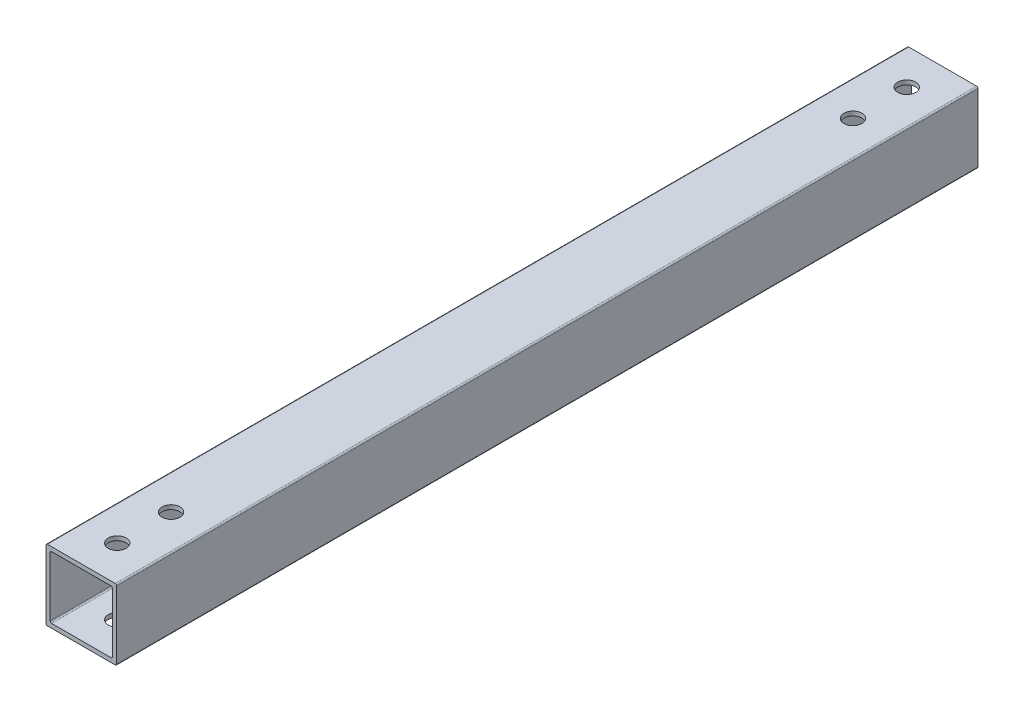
ISO-10303-21;
HEADER;
FILE_DESCRIPTION(('STEP AP214'),'2;1');
FILE_NAME('part.step','',(''),(''),'','','');
FILE_SCHEMA(('AUTOMOTIVE_DESIGN { 1 0 10303 214 1 1 1 1 }'));
ENDSEC;
DATA;
#1=APPLICATION_CONTEXT('core data for automotive mechanical design processes');
#2=APPLICATION_PROTOCOL_DEFINITION('international standard','automotive_design',2000,#1);
#3=PRODUCT_CONTEXT('',#1,'mechanical');
#4=PRODUCT('Part','Part','',(#3));
#5=PRODUCT_RELATED_PRODUCT_CATEGORY('part','',(#4));
#6=PRODUCT_DEFINITION_FORMATION('','',#4);
#7=PRODUCT_DEFINITION_CONTEXT('part definition',#1,'design');
#8=PRODUCT_DEFINITION('design','',#6,#7);
#9=PRODUCT_DEFINITION_SHAPE('','',#8);
#10=(LENGTH_UNIT() NAMED_UNIT(*) SI_UNIT(.MILLI.,.METRE.));
#11=(NAMED_UNIT(*) PLANE_ANGLE_UNIT() SI_UNIT($,.RADIAN.));
#12=(NAMED_UNIT(*) SI_UNIT($,.STERADIAN.) SOLID_ANGLE_UNIT());
#13=UNCERTAINTY_MEASURE_WITH_UNIT(LENGTH_MEASURE(1.E-05),#10,'distance_accuracy_value','');
#14=(GEOMETRIC_REPRESENTATION_CONTEXT(3) GLOBAL_UNCERTAINTY_ASSIGNED_CONTEXT((#13)) GLOBAL_UNIT_ASSIGNED_CONTEXT((#10,
#11,#12)) REPRESENTATION_CONTEXT('',''));
#15=CARTESIAN_POINT('',(0.,0.,0.));
#16=DIRECTION('',(0.,0.,1.));
#17=DIRECTION('',(1.,0.,0.));
#18=AXIS2_PLACEMENT_3D('',#15,#16,#17);
#19=CARTESIAN_POINT('',(-11.9999999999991,-11.9999999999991,-1695.2));
#20=DIRECTION('',(0.,0.,-1.));
#21=DIRECTION('',(-1.,0.,0.));
#22=AXIS2_PLACEMENT_3D('',#19,#20,#21);
#23=CYLINDRICAL_SURFACE('',#22,0.500000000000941);
#24=CARTESIAN_POINT('',(-11.9999999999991,-11.9999999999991,-2000.));
#25=DIRECTION('',(0.,0.,-1.));
#26=DIRECTION('',(-1.,0.,0.));
#27=AXIS2_PLACEMENT_3D('',#24,#25,#26);
#28=CIRCLE('',#27,0.500000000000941);
#29=CARTESIAN_POINT('',(-11.9999999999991,-12.5,-2000.));
#30=VERTEX_POINT('',#29);
#31=CARTESIAN_POINT('',(-12.5,-11.9999999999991,-2000.));
#32=VERTEX_POINT('',#31);
#33=EDGE_CURVE('E220',#30,#32,#28,.T.);
#34=ORIENTED_EDGE('',*,*,#33,.F.);
#35=DIRECTION('',(0.,0.,-1.));
#36=VECTOR('',#35,1.);
#37=CARTESIAN_POINT('',(-11.9999999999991,-12.5,-1695.2));
#38=LINE('',#37,#36);
#39=CARTESIAN_POINT('',(-11.9999999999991,-12.5,-1695.2));
#40=VERTEX_POINT('',#39);
#41=EDGE_CURVE('E11',#40,#30,#38,.T.);
#42=ORIENTED_EDGE('',*,*,#41,.F.);
#43=CARTESIAN_POINT('',(-11.9999999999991,-11.9999999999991,-1695.2));
#44=DIRECTION('',(0.,0.,-1.));
#45=DIRECTION('',(-1.,0.,0.));
#46=AXIS2_PLACEMENT_3D('',#43,#44,#45);
#47=CIRCLE('',#46,0.500000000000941);
#48=CARTESIAN_POINT('',(-12.5,-11.9999999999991,-1695.2));
#49=VERTEX_POINT('',#48);
#50=EDGE_CURVE('E232',#40,#49,#47,.T.);
#51=ORIENTED_EDGE('',*,*,#50,.T.);
#52=DIRECTION('',(0.,0.,-1.));
#53=VECTOR('',#52,1.);
#54=CARTESIAN_POINT('',(-12.5,-11.9999999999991,-1695.2));
#55=LINE('',#54,#53);
#56=EDGE_CURVE('E257',#49,#32,#55,.T.);
#57=ORIENTED_EDGE('',*,*,#56,.T.);
#58=EDGE_LOOP('',(#34,#42,#51,#57));
#59=FACE_BOUND('',#58,.T.);
#60=ADVANCED_FACE('F47',(#59),#23,.T.);
#61=CARTESIAN_POINT('',(11.9999999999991,-12.5,-1695.2));
#62=DIRECTION('',(0.,-1.,0.));
#63=DIRECTION('',(1.,0.,0.));
#64=AXIS2_PLACEMENT_3D('',#61,#62,#63);
#65=PLANE('',#64);
#66=CARTESIAN_POINT('',(0.,-12.5,-1987.3));
#67=DIRECTION('',(0.,-1.,0.));
#68=DIRECTION('',(1.,0.,0.));
#69=AXIS2_PLACEMENT_3D('',#66,#67,#68);
#70=CIRCLE('',#69,3.17500000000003);
#71=CARTESIAN_POINT('',(3.17500000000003,-12.5,-1987.3));
#72=VERTEX_POINT('',#71);
#73=EDGE_CURVE('E296',#72,#72,#70,.F.);
#74=ORIENTED_EDGE('',*,*,#73,.T.);
#75=EDGE_LOOP('',(#74));
#76=FACE_BOUND('',#75,.T.);
#77=CARTESIAN_POINT('',(0.,-12.5,-1726.95));
#78=DIRECTION('',(0.,-1.,0.));
#79=DIRECTION('',(1.,0.,0.));
#80=AXIS2_PLACEMENT_3D('',#77,#78,#79);
#81=CIRCLE('',#80,3.17500000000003);
#82=CARTESIAN_POINT('',(3.17500000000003,-12.5,-1726.95));
#83=VERTEX_POINT('',#82);
#84=EDGE_CURVE('E329',#83,#83,#81,.F.);
#85=ORIENTED_EDGE('',*,*,#84,.T.);
#86=EDGE_LOOP('',(#85));
#87=FACE_BOUND('',#86,.T.);
#88=CARTESIAN_POINT('',(0.,-12.5,-1707.9));
#89=DIRECTION('',(0.,-1.,0.));
#90=DIRECTION('',(1.,0.,0.));
#91=AXIS2_PLACEMENT_3D('',#88,#89,#90);
#92=CIRCLE('',#91,3.17500000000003);
#93=CARTESIAN_POINT('',(3.17500000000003,-12.5,-1707.9));
#94=VERTEX_POINT('',#93);
#95=EDGE_CURVE('E317',#94,#94,#92,.F.);
#96=ORIENTED_EDGE('',*,*,#95,.T.);
#97=EDGE_LOOP('',(#96));
#98=FACE_BOUND('',#97,.T.);
#99=CARTESIAN_POINT('',(0.,-12.5,-1968.25));
#100=DIRECTION('',(0.,-1.,0.));
#101=DIRECTION('',(1.,0.,0.));
#102=AXIS2_PLACEMENT_3D('',#99,#100,#101);
#103=CIRCLE('',#102,3.17500000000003);
#104=CARTESIAN_POINT('',(3.17500000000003,-12.5,-1968.25));
#105=VERTEX_POINT('',#104);
#106=EDGE_CURVE('E316',#105,#105,#103,.F.);
#107=ORIENTED_EDGE('',*,*,#106,.T.);
#108=EDGE_LOOP('',(#107));
#109=FACE_BOUND('',#108,.T.);
#110=DIRECTION('',(-1.,0.,0.));
#111=VECTOR('',#110,1.);
#112=CARTESIAN_POINT('',(11.9999999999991,-12.5,-2000.));
#113=LINE('',#112,#111);
#114=CARTESIAN_POINT('',(11.9999999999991,-12.5,-2000.));
#115=VERTEX_POINT('',#114);
#116=EDGE_CURVE('E236',#115,#30,#113,.T.);
#117=ORIENTED_EDGE('',*,*,#116,.F.);
#118=DIRECTION('',(0.,0.,-1.));
#119=VECTOR('',#118,1.);
#120=CARTESIAN_POINT('',(11.9999999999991,-12.5,-1695.2));
#121=LINE('',#120,#119);
#122=CARTESIAN_POINT('',(11.9999999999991,-12.5,-1695.2));
#123=VERTEX_POINT('',#122);
#124=EDGE_CURVE('E55',#123,#115,#121,.T.);
#125=ORIENTED_EDGE('',*,*,#124,.F.);
#126=DIRECTION('',(-1.,0.,0.));
#127=VECTOR('',#126,1.);
#128=CARTESIAN_POINT('',(11.9999999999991,-12.5,-1695.2));
#129=LINE('',#128,#127);
#130=EDGE_CURVE('E254',#123,#40,#129,.T.);
#131=ORIENTED_EDGE('',*,*,#130,.T.);
#132=ORIENTED_EDGE('',*,*,#41,.T.);
#133=EDGE_LOOP('',(#117,#125,#131,#132));
#134=FACE_BOUND('',#133,.T.);
#135=ADVANCED_FACE('F372',(#76,#87,#98,#109,#134),#65,.T.);
#136=CARTESIAN_POINT('',(11.9999999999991,-11.9999999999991,-1695.2));
#137=DIRECTION('',(0.,0.,-1.));
#138=DIRECTION('',(-1.,0.,0.));
#139=AXIS2_PLACEMENT_3D('',#136,#137,#138);
#140=CYLINDRICAL_SURFACE('',#139,0.500000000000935);
#141=CARTESIAN_POINT('',(11.9999999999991,-11.9999999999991,-2000.));
#142=DIRECTION('',(0.,0.,-1.));
#143=DIRECTION('',(-1.,0.,0.));
#144=AXIS2_PLACEMENT_3D('',#141,#142,#143);
#145=CIRCLE('',#144,0.500000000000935);
#146=CARTESIAN_POINT('',(12.5,-11.9999999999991,-2000.));
#147=VERTEX_POINT('',#146);
#148=EDGE_CURVE('E275',#147,#115,#145,.T.);
#149=ORIENTED_EDGE('',*,*,#148,.F.);
#150=DIRECTION('',(0.,0.,-1.));
#151=VECTOR('',#150,1.);
#152=CARTESIAN_POINT('',(12.5,-11.9999999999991,-1695.2));
#153=LINE('',#152,#151);
#154=CARTESIAN_POINT('',(12.5,-11.9999999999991,-1695.2));
#155=VERTEX_POINT('',#154);
#156=EDGE_CURVE('E281',#155,#147,#153,.T.);
#157=ORIENTED_EDGE('',*,*,#156,.F.);
#158=CARTESIAN_POINT('',(11.9999999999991,-11.9999999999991,-1695.2));
#159=DIRECTION('',(0.,0.,-1.));
#160=DIRECTION('',(-1.,0.,0.));
#161=AXIS2_PLACEMENT_3D('',#158,#159,#160);
#162=CIRCLE('',#161,0.500000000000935);
#163=EDGE_CURVE('E251',#155,#123,#162,.T.);
#164=ORIENTED_EDGE('',*,*,#163,.T.);
#165=ORIENTED_EDGE('',*,*,#124,.T.);
#166=EDGE_LOOP('',(#149,#157,#164,#165));
#167=FACE_BOUND('',#166,.T.);
#168=ADVANCED_FACE('F375',(#167),#140,.T.);
#169=CARTESIAN_POINT('',(12.5,11.9999999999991,-1695.2));
#170=DIRECTION('',(1.,0.,0.));
#171=DIRECTION('',(0.,1.,0.));
#172=AXIS2_PLACEMENT_3D('',#169,#170,#171);
#173=PLANE('',#172);
#174=DIRECTION('',(0.,-1.,0.));
#175=VECTOR('',#174,1.);
#176=CARTESIAN_POINT('',(12.5,11.9999999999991,-2000.));
#177=LINE('',#176,#175);
#178=CARTESIAN_POINT('',(12.5,11.9999999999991,-2000.));
#179=VERTEX_POINT('',#178);
#180=EDGE_CURVE('E272',#179,#147,#177,.T.);
#181=ORIENTED_EDGE('',*,*,#180,.F.);
#182=DIRECTION('',(0.,0.,-1.));
#183=VECTOR('',#182,1.);
#184=CARTESIAN_POINT('',(12.5,11.9999999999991,-1695.2));
#185=LINE('',#184,#183);
#186=CARTESIAN_POINT('',(12.5,11.9999999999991,-1695.2));
#187=VERTEX_POINT('',#186);
#188=EDGE_CURVE('E283',#187,#179,#185,.T.);
#189=ORIENTED_EDGE('',*,*,#188,.F.);
#190=DIRECTION('',(0.,-1.,0.));
#191=VECTOR('',#190,1.);
#192=CARTESIAN_POINT('',(12.5,11.9999999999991,-1695.2));
#193=LINE('',#192,#191);
#194=EDGE_CURVE('E248',#187,#155,#193,.T.);
#195=ORIENTED_EDGE('',*,*,#194,.T.);
#196=ORIENTED_EDGE('',*,*,#156,.T.);
#197=EDGE_LOOP('',(#181,#189,#195,#196));
#198=FACE_BOUND('',#197,.T.);
#199=ADVANCED_FACE('F379',(#198),#173,.T.);
#200=CARTESIAN_POINT('',(11.9999999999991,11.9999999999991,-1695.2));
#201=DIRECTION('',(0.,0.,-1.));
#202=DIRECTION('',(-1.,0.,0.));
#203=AXIS2_PLACEMENT_3D('',#200,#201,#202);
#204=CYLINDRICAL_SURFACE('',#203,0.500000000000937);
#205=CARTESIAN_POINT('',(11.9999999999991,11.9999999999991,-2000.));
#206=DIRECTION('',(0.,0.,-1.));
#207=DIRECTION('',(-1.,0.,0.));
#208=AXIS2_PLACEMENT_3D('',#205,#206,#207);
#209=CIRCLE('',#208,0.500000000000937);
#210=CARTESIAN_POINT('',(11.9999999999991,12.5,-2000.));
#211=VERTEX_POINT('',#210);
#212=EDGE_CURVE('E269',#211,#179,#209,.T.);
#213=ORIENTED_EDGE('',*,*,#212,.F.);
#214=DIRECTION('',(0.,0.,-1.));
#215=VECTOR('',#214,1.);
#216=CARTESIAN_POINT('',(11.9999999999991,12.5,-1695.2));
#217=LINE('',#216,#215);
#218=CARTESIAN_POINT('',(11.9999999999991,12.5,-1695.2));
#219=VERTEX_POINT('',#218);
#220=EDGE_CURVE('E285',#219,#211,#217,.T.);
#221=ORIENTED_EDGE('',*,*,#220,.F.);
#222=CARTESIAN_POINT('',(11.9999999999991,11.9999999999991,-1695.2));
#223=DIRECTION('',(0.,0.,-1.));
#224=DIRECTION('',(-1.,0.,0.));
#225=AXIS2_PLACEMENT_3D('',#222,#223,#224);
#226=CIRCLE('',#225,0.500000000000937);
#227=EDGE_CURVE('E245',#219,#187,#226,.T.);
#228=ORIENTED_EDGE('',*,*,#227,.T.);
#229=ORIENTED_EDGE('',*,*,#188,.T.);
#230=EDGE_LOOP('',(#213,#221,#228,#229));
#231=FACE_BOUND('',#230,.T.);
#232=ADVANCED_FACE('F344',(#231),#204,.T.);
#233=CARTESIAN_POINT('',(-11.9999999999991,12.5,-1695.2));
#234=DIRECTION('',(0.,1.,0.));
#235=DIRECTION('',(-1.,0.,0.));
#236=AXIS2_PLACEMENT_3D('',#233,#234,#235);
#237=PLANE('',#236);
#238=CARTESIAN_POINT('',(0.,12.5,-1987.3));
#239=DIRECTION('',(0.,1.,0.));
#240=DIRECTION('',(-1.,0.,0.));
#241=AXIS2_PLACEMENT_3D('',#238,#239,#240);
#242=CIRCLE('',#241,3.17500000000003);
#243=CARTESIAN_POINT('',(-3.17500000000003,12.5,-1987.3));
#244=VERTEX_POINT('',#243);
#245=EDGE_CURVE('E324',#244,#244,#242,.T.);
#246=ORIENTED_EDGE('',*,*,#245,.F.);
#247=EDGE_LOOP('',(#246));
#248=FACE_BOUND('',#247,.T.);
#249=CARTESIAN_POINT('',(0.,12.5,-1726.95));
#250=DIRECTION('',(0.,1.,0.));
#251=DIRECTION('',(1.,0.,0.));
#252=AXIS2_PLACEMENT_3D('',#249,#250,#251);
#253=CIRCLE('',#252,3.17500000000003);
#254=CARTESIAN_POINT('',(3.17500000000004,12.5,-1726.95));
#255=VERTEX_POINT('',#254);
#256=EDGE_CURVE('E320',#255,#255,#253,.T.);
#257=ORIENTED_EDGE('',*,*,#256,.F.);
#258=EDGE_LOOP('',(#257));
#259=FACE_BOUND('',#258,.T.);
#260=CARTESIAN_POINT('',(0.,12.5,-1707.9));
#261=DIRECTION('',(0.,1.,0.));
#262=DIRECTION('',(1.,0.,0.));
#263=AXIS2_PLACEMENT_3D('',#260,#261,#262);
#264=CIRCLE('',#263,3.17500000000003);
#265=CARTESIAN_POINT('',(3.17500000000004,12.5,-1707.9));
#266=VERTEX_POINT('',#265);
#267=EDGE_CURVE('E313',#266,#266,#264,.T.);
#268=ORIENTED_EDGE('',*,*,#267,.F.);
#269=EDGE_LOOP('',(#268));
#270=FACE_BOUND('',#269,.T.);
#271=CARTESIAN_POINT('',(0.,12.5,-1968.25));
#272=DIRECTION('',(0.,1.,0.));
#273=DIRECTION('',(-1.,0.,0.));
#274=AXIS2_PLACEMENT_3D('',#271,#272,#273);
#275=CIRCLE('',#274,3.17500000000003);
#276=CARTESIAN_POINT('',(-3.17500000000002,12.5,-1968.25));
#277=VERTEX_POINT('',#276);
#278=EDGE_CURVE('E321',#277,#277,#275,.T.);
#279=ORIENTED_EDGE('',*,*,#278,.F.);
#280=EDGE_LOOP('',(#279));
#281=FACE_BOUND('',#280,.T.);
#282=DIRECTION('',(1.,0.,0.));
#283=VECTOR('',#282,1.);
#284=CARTESIAN_POINT('',(-11.9999999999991,12.5,-2000.));
#285=LINE('',#284,#283);
#286=CARTESIAN_POINT('',(-11.9999999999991,12.5,-2000.));
#287=VERTEX_POINT('',#286);
#288=EDGE_CURVE('E266',#287,#211,#285,.T.);
#289=ORIENTED_EDGE('',*,*,#288,.F.);
#290=DIRECTION('',(0.,0.,-1.));
#291=VECTOR('',#290,1.);
#292=CARTESIAN_POINT('',(-11.9999999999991,12.5,-1695.2));
#293=LINE('',#292,#291);
#294=CARTESIAN_POINT('',(-11.9999999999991,12.5,-1695.2));
#295=VERTEX_POINT('',#294);
#296=EDGE_CURVE('E287',#295,#287,#293,.T.);
#297=ORIENTED_EDGE('',*,*,#296,.F.);
#298=DIRECTION('',(1.,0.,0.));
#299=VECTOR('',#298,1.);
#300=CARTESIAN_POINT('',(-11.9999999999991,12.5,-1695.2));
#301=LINE('',#300,#299);
#302=EDGE_CURVE('E242',#295,#219,#301,.T.);
#303=ORIENTED_EDGE('',*,*,#302,.T.);
#304=ORIENTED_EDGE('',*,*,#220,.T.);
#305=EDGE_LOOP('',(#289,#297,#303,#304));
#306=FACE_BOUND('',#305,.T.);
#307=ADVANCED_FACE('F340',(#248,#259,#270,#281,#306),#237,.T.);
#308=CARTESIAN_POINT('',(-11.9999999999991,11.9999999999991,-1695.2));
#309=DIRECTION('',(0.,0.,-1.));
#310=DIRECTION('',(-1.,0.,0.));
#311=AXIS2_PLACEMENT_3D('',#308,#309,#310);
#312=CYLINDRICAL_SURFACE('',#311,0.500000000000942);
#313=CARTESIAN_POINT('',(-11.9999999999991,11.9999999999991,-2000.));
#314=DIRECTION('',(0.,0.,-1.));
#315=DIRECTION('',(-1.,0.,0.));
#316=AXIS2_PLACEMENT_3D('',#313,#314,#315);
#317=CIRCLE('',#316,0.500000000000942);
#318=CARTESIAN_POINT('',(-12.5,11.9999999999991,-2000.));
#319=VERTEX_POINT('',#318);
#320=EDGE_CURVE('E263',#319,#287,#317,.T.);
#321=ORIENTED_EDGE('',*,*,#320,.F.);
#322=DIRECTION('',(0.,0.,-1.));
#323=VECTOR('',#322,1.);
#324=CARTESIAN_POINT('',(-12.5,11.9999999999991,-1695.2));
#325=LINE('',#324,#323);
#326=CARTESIAN_POINT('',(-12.5,11.9999999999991,-1695.2));
#327=VERTEX_POINT('',#326);
#328=EDGE_CURVE('E289',#327,#319,#325,.T.);
#329=ORIENTED_EDGE('',*,*,#328,.F.);
#330=CARTESIAN_POINT('',(-11.9999999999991,11.9999999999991,-1695.2));
#331=DIRECTION('',(0.,0.,-1.));
#332=DIRECTION('',(-1.,0.,0.));
#333=AXIS2_PLACEMENT_3D('',#330,#331,#332);
#334=CIRCLE('',#333,0.500000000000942);
#335=EDGE_CURVE('E239',#327,#295,#334,.T.);
#336=ORIENTED_EDGE('',*,*,#335,.T.);
#337=ORIENTED_EDGE('',*,*,#296,.T.);
#338=EDGE_LOOP('',(#321,#329,#336,#337));
#339=FACE_BOUND('',#338,.T.);
#340=ADVANCED_FACE('F343',(#339),#312,.T.);
#341=CARTESIAN_POINT('',(-12.5,-11.9999999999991,-1695.2));
#342=DIRECTION('',(-1.,0.,0.));
#343=DIRECTION('',(0.,0.,1.));
#344=AXIS2_PLACEMENT_3D('',#341,#342,#343);
#345=PLANE('',#344);
#346=DIRECTION('',(0.,1.,0.));
#347=VECTOR('',#346,1.);
#348=CARTESIAN_POINT('',(-12.5,-11.9999999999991,-2000.));
#349=LINE('',#348,#347);
#350=EDGE_CURVE('E260',#32,#319,#349,.T.);
#351=ORIENTED_EDGE('',*,*,#350,.F.);
#352=ORIENTED_EDGE('',*,*,#56,.F.);
#353=DIRECTION('',(0.,1.,0.));
#354=VECTOR('',#353,1.);
#355=CARTESIAN_POINT('',(-12.5,-11.9999999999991,-1695.2));
#356=LINE('',#355,#354);
#357=EDGE_CURVE('E235',#49,#327,#356,.T.);
#358=ORIENTED_EDGE('',*,*,#357,.T.);
#359=ORIENTED_EDGE('',*,*,#328,.T.);
#360=EDGE_LOOP('',(#351,#352,#358,#359));
#361=FACE_BOUND('',#360,.T.);
#362=ADVANCED_FACE('F365',(#361),#345,.T.);
#363=CARTESIAN_POINT('',(-11.9999999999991,-11.9999999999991,-1695.2));
#364=DIRECTION('',(0.,0.,-1.));
#365=DIRECTION('',(-1.,0.,0.));
#366=AXIS2_PLACEMENT_3D('',#363,#364,#365);
#367=PLANE('',#366);
#368=DIRECTION('',(0.,1.,0.));
#369=VECTOR('',#368,1.);
#370=CARTESIAN_POINT('',(-11.,10.4999999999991,-1695.2));
#371=LINE('',#370,#369);
#372=CARTESIAN_POINT('',(-11.,-10.4999999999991,-1695.2));
#373=VERTEX_POINT('',#372);
#374=CARTESIAN_POINT('',(-11.,10.4999999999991,-1695.2));
#375=VERTEX_POINT('',#374);
#376=EDGE_CURVE('E168',#373,#375,#371,.T.);
#377=ORIENTED_EDGE('',*,*,#376,.T.);
#378=CARTESIAN_POINT('',(-10.4999999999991,10.4999999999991,-1695.2));
#379=DIRECTION('',(0.,0.,-1.));
#380=DIRECTION('',(1.,0.,0.));
#381=AXIS2_PLACEMENT_3D('',#378,#379,#380);
#382=CIRCLE('',#381,0.500000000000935);
#383=CARTESIAN_POINT('',(-10.4999999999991,11.,-1695.2));
#384=VERTEX_POINT('',#383);
#385=EDGE_CURVE('E162',#375,#384,#382,.T.);
#386=ORIENTED_EDGE('',*,*,#385,.T.);
#387=DIRECTION('',(1.,0.,0.));
#388=VECTOR('',#387,1.);
#389=CARTESIAN_POINT('',(10.4999999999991,11.,-1695.2));
#390=LINE('',#389,#388);
#391=CARTESIAN_POINT('',(10.4999999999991,11.,-1695.2));
#392=VERTEX_POINT('',#391);
#393=EDGE_CURVE('E171',#384,#392,#390,.T.);
#394=ORIENTED_EDGE('',*,*,#393,.T.);
#395=CARTESIAN_POINT('',(10.4999999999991,10.4999999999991,-1695.2));
#396=DIRECTION('',(0.,0.,-1.));
#397=DIRECTION('',(1.,0.,0.));
#398=AXIS2_PLACEMENT_3D('',#395,#396,#397);
#399=CIRCLE('',#398,0.500000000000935);
#400=CARTESIAN_POINT('',(11.,10.4999999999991,-1695.2));
#401=VERTEX_POINT('',#400);
#402=EDGE_CURVE('E63',#392,#401,#399,.T.);
#403=ORIENTED_EDGE('',*,*,#402,.T.);
#404=DIRECTION('',(0.,-1.,0.));
#405=VECTOR('',#404,1.);
#406=CARTESIAN_POINT('',(11.,-10.4999999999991,-1695.2));
#407=LINE('',#406,#405);
#408=CARTESIAN_POINT('',(11.,-10.4999999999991,-1695.2));
#409=VERTEX_POINT('',#408);
#410=EDGE_CURVE('E189',#401,#409,#407,.T.);
#411=ORIENTED_EDGE('',*,*,#410,.T.);
#412=CARTESIAN_POINT('',(10.4999999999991,-10.4999999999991,-1695.2));
#413=DIRECTION('',(0.,0.,-1.));
#414=DIRECTION('',(1.,0.,0.));
#415=AXIS2_PLACEMENT_3D('',#412,#413,#414);
#416=CIRCLE('',#415,0.500000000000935);
#417=CARTESIAN_POINT('',(10.4999999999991,-11.,-1695.2));
#418=VERTEX_POINT('',#417);
#419=EDGE_CURVE('E192',#409,#418,#416,.T.);
#420=ORIENTED_EDGE('',*,*,#419,.T.);
#421=DIRECTION('',(-1.,0.,0.));
#422=VECTOR('',#421,1.);
#423=CARTESIAN_POINT('',(-10.4999999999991,-11.,-1695.2));
#424=LINE('',#423,#422);
#425=CARTESIAN_POINT('',(-10.4999999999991,-11.,-1695.2));
#426=VERTEX_POINT('',#425);
#427=EDGE_CURVE('E195',#418,#426,#424,.T.);
#428=ORIENTED_EDGE('',*,*,#427,.T.);
#429=CARTESIAN_POINT('',(-10.4999999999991,-10.4999999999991,-1695.2));
#430=DIRECTION('',(0.,0.,-1.));
#431=DIRECTION('',(1.,0.,0.));
#432=AXIS2_PLACEMENT_3D('',#429,#430,#431);
#433=CIRCLE('',#432,0.500000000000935);
#434=EDGE_CURVE('E198',#426,#373,#433,.T.);
#435=ORIENTED_EDGE('',*,*,#434,.T.);
#436=EDGE_LOOP('',(#377,#386,#394,#403,#411,#420,#428,#435));
#437=FACE_BOUND('',#436,.T.);
#438=ORIENTED_EDGE('',*,*,#50,.F.);
#439=ORIENTED_EDGE('',*,*,#130,.F.);
#440=ORIENTED_EDGE('',*,*,#163,.F.);
#441=ORIENTED_EDGE('',*,*,#194,.F.);
#442=ORIENTED_EDGE('',*,*,#227,.F.);
#443=ORIENTED_EDGE('',*,*,#302,.F.);
#444=ORIENTED_EDGE('',*,*,#335,.F.);
#445=ORIENTED_EDGE('',*,*,#357,.F.);
#446=EDGE_LOOP('',(#438,#439,#440,#441,#442,#443,#444,#445));
#447=FACE_BOUND('',#446,.T.);
#448=ADVANCED_FACE('F175',(#437,#447),#367,.F.);
#449=CARTESIAN_POINT('',(-11.9999999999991,-11.9999999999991,-2000.));
#450=DIRECTION('',(0.,0.,-1.));
#451=DIRECTION('',(-1.,0.,0.));
#452=AXIS2_PLACEMENT_3D('',#449,#450,#451);
#453=PLANE('',#452);
#454=CARTESIAN_POINT('',(-10.4999999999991,10.4999999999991,-2000.));
#455=DIRECTION('',(0.,0.,-1.));
#456=DIRECTION('',(1.,0.,0.));
#457=AXIS2_PLACEMENT_3D('',#454,#455,#456);
#458=CIRCLE('',#457,0.500000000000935);
#459=CARTESIAN_POINT('',(-11.,10.4999999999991,-2000.));
#460=VERTEX_POINT('',#459);
#461=CARTESIAN_POINT('',(-10.4999999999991,11.,-2000.));
#462=VERTEX_POINT('',#461);
#463=EDGE_CURVE('E71',#460,#462,#458,.T.);
#464=ORIENTED_EDGE('',*,*,#463,.F.);
#465=DIRECTION('',(0.,1.,0.));
#466=VECTOR('',#465,1.);
#467=CARTESIAN_POINT('',(-11.,10.4999999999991,-2000.));
#468=LINE('',#467,#466);
#469=CARTESIAN_POINT('',(-11.,-10.4999999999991,-2000.));
#470=VERTEX_POINT('',#469);
#471=EDGE_CURVE('E179',#470,#460,#468,.T.);
#472=ORIENTED_EDGE('',*,*,#471,.F.);
#473=CARTESIAN_POINT('',(-10.4999999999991,-10.4999999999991,-2000.));
#474=DIRECTION('',(0.,0.,-1.));
#475=DIRECTION('',(1.,0.,0.));
#476=AXIS2_PLACEMENT_3D('',#473,#474,#475);
#477=CIRCLE('',#476,0.500000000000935);
#478=CARTESIAN_POINT('',(-10.4999999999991,-11.,-2000.));
#479=VERTEX_POINT('',#478);
#480=EDGE_CURVE('E182',#479,#470,#477,.T.);
#481=ORIENTED_EDGE('',*,*,#480,.F.);
#482=DIRECTION('',(-1.,0.,0.));
#483=VECTOR('',#482,1.);
#484=CARTESIAN_POINT('',(-10.4999999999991,-11.,-2000.));
#485=LINE('',#484,#483);
#486=CARTESIAN_POINT('',(10.4999999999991,-11.,-2000.));
#487=VERTEX_POINT('',#486);
#488=EDGE_CURVE('E213',#487,#479,#485,.T.);
#489=ORIENTED_EDGE('',*,*,#488,.F.);
#490=CARTESIAN_POINT('',(10.4999999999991,-10.4999999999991,-2000.));
#491=DIRECTION('',(0.,0.,-1.));
#492=DIRECTION('',(1.,0.,0.));
#493=AXIS2_PLACEMENT_3D('',#490,#491,#492);
#494=CIRCLE('',#493,0.500000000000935);
#495=CARTESIAN_POINT('',(11.,-10.4999999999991,-2000.));
#496=VERTEX_POINT('',#495);
#497=EDGE_CURVE('E210',#496,#487,#494,.T.);
#498=ORIENTED_EDGE('',*,*,#497,.F.);
#499=DIRECTION('',(0.,-1.,0.));
#500=VECTOR('',#499,1.);
#501=CARTESIAN_POINT('',(11.,-10.4999999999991,-2000.));
#502=LINE('',#501,#500);
#503=CARTESIAN_POINT('',(11.,10.4999999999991,-2000.));
#504=VERTEX_POINT('',#503);
#505=EDGE_CURVE('E207',#504,#496,#502,.T.);
#506=ORIENTED_EDGE('',*,*,#505,.F.);
#507=CARTESIAN_POINT('',(10.4999999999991,10.4999999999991,-2000.));
#508=DIRECTION('',(0.,0.,-1.));
#509=DIRECTION('',(1.,0.,0.));
#510=AXIS2_PLACEMENT_3D('',#507,#508,#509);
#511=CIRCLE('',#510,0.500000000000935);
#512=CARTESIAN_POINT('',(10.4999999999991,11.,-2000.));
#513=VERTEX_POINT('',#512);
#514=EDGE_CURVE('E204',#513,#504,#511,.T.);
#515=ORIENTED_EDGE('',*,*,#514,.F.);
#516=DIRECTION('',(1.,0.,0.));
#517=VECTOR('',#516,1.);
#518=CARTESIAN_POINT('',(10.4999999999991,11.,-2000.));
#519=LINE('',#518,#517);
#520=EDGE_CURVE('E202',#462,#513,#519,.T.);
#521=ORIENTED_EDGE('',*,*,#520,.F.);
#522=EDGE_LOOP('',(#464,#472,#481,#489,#498,#506,#515,#521));
#523=FACE_BOUND('',#522,.T.);
#524=ORIENTED_EDGE('',*,*,#33,.T.);
#525=ORIENTED_EDGE('',*,*,#350,.T.);
#526=ORIENTED_EDGE('',*,*,#320,.T.);
#527=ORIENTED_EDGE('',*,*,#288,.T.);
#528=ORIENTED_EDGE('',*,*,#212,.T.);
#529=ORIENTED_EDGE('',*,*,#180,.T.);
#530=ORIENTED_EDGE('',*,*,#148,.T.);
#531=ORIENTED_EDGE('',*,*,#116,.T.);
#532=EDGE_LOOP('',(#524,#525,#526,#527,#528,#529,#530,#531));
#533=FACE_BOUND('',#532,.T.);
#534=ADVANCED_FACE('F357',(#523,#533),#453,.T.);
#535=CARTESIAN_POINT('',(-10.4999999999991,10.4999999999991,-1695.2));
#536=DIRECTION('',(0.,0.,-1.));
#537=DIRECTION('',(-1.,0.,0.));
#538=AXIS2_PLACEMENT_3D('',#535,#536,#537);
#539=CYLINDRICAL_SURFACE('',#538,0.500000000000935);
#540=ORIENTED_EDGE('',*,*,#463,.T.);
#541=DIRECTION('',(0.,0.,-1.));
#542=VECTOR('',#541,1.);
#543=CARTESIAN_POINT('',(-10.4999999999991,11.,-1695.2));
#544=LINE('',#543,#542);
#545=EDGE_CURVE('E158',#384,#462,#544,.T.);
#546=ORIENTED_EDGE('',*,*,#545,.F.);
#547=ORIENTED_EDGE('',*,*,#385,.F.);
#548=DIRECTION('',(0.,0.,-1.));
#549=VECTOR('',#548,1.);
#550=CARTESIAN_POINT('',(-11.,10.4999999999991,-1695.2));
#551=LINE('',#550,#549);
#552=EDGE_CURVE('E218',#375,#460,#551,.T.);
#553=ORIENTED_EDGE('',*,*,#552,.T.);
#554=EDGE_LOOP('',(#540,#546,#547,#553));
#555=FACE_BOUND('',#554,.T.);
#556=ADVANCED_FACE('F160',(#555),#539,.F.);
#557=CARTESIAN_POINT('',(-11.,10.4999999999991,-1695.2));
#558=DIRECTION('',(-1.,0.,0.));
#559=DIRECTION('',(0.,-1.,0.));
#560=AXIS2_PLACEMENT_3D('',#557,#558,#559);
#561=PLANE('',#560);
#562=ORIENTED_EDGE('',*,*,#471,.T.);
#563=ORIENTED_EDGE('',*,*,#552,.F.);
#564=ORIENTED_EDGE('',*,*,#376,.F.);
#565=DIRECTION('',(0.,0.,-1.));
#566=VECTOR('',#565,1.);
#567=CARTESIAN_POINT('',(-11.,-10.4999999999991,-1695.2));
#568=LINE('',#567,#566);
#569=EDGE_CURVE('E221',#373,#470,#568,.T.);
#570=ORIENTED_EDGE('',*,*,#569,.T.);
#571=EDGE_LOOP('',(#562,#563,#564,#570));
#572=FACE_BOUND('',#571,.T.);
#573=ADVANCED_FACE('F406',(#572),#561,.F.);
#574=CARTESIAN_POINT('',(-10.4999999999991,-10.4999999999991,-1695.2));
#575=DIRECTION('',(0.,0.,-1.));
#576=DIRECTION('',(-1.,0.,0.));
#577=AXIS2_PLACEMENT_3D('',#574,#575,#576);
#578=CYLINDRICAL_SURFACE('',#577,0.500000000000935);
#579=ORIENTED_EDGE('',*,*,#480,.T.);
#580=ORIENTED_EDGE('',*,*,#569,.F.);
#581=ORIENTED_EDGE('',*,*,#434,.F.);
#582=DIRECTION('',(0.,0.,-1.));
#583=VECTOR('',#582,1.);
#584=CARTESIAN_POINT('',(-10.4999999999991,-11.,-1695.2));
#585=LINE('',#584,#583);
#586=EDGE_CURVE('E223',#426,#479,#585,.T.);
#587=ORIENTED_EDGE('',*,*,#586,.T.);
#588=EDGE_LOOP('',(#579,#580,#581,#587));
#589=FACE_BOUND('',#588,.T.);
#590=ADVANCED_FACE('F425',(#589),#578,.F.);
#591=CARTESIAN_POINT('',(-10.4999999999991,-11.,-1695.2));
#592=DIRECTION('',(0.,-1.,0.));
#593=DIRECTION('',(0.,0.,-1.));
#594=AXIS2_PLACEMENT_3D('',#591,#592,#593);
#595=PLANE('',#594);
#596=CARTESIAN_POINT('',(0.,-11.,-1987.3));
#597=DIRECTION('',(0.,-1.,0.));
#598=DIRECTION('',(0.,0.,-1.));
#599=AXIS2_PLACEMENT_3D('',#596,#597,#598);
#600=CIRCLE('',#599,3.17500000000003);
#601=CARTESIAN_POINT('',(0.,-11.,-1990.475));
#602=VERTEX_POINT('',#601);
#603=EDGE_CURVE('E185',#602,#602,#600,.T.);
#604=ORIENTED_EDGE('',*,*,#603,.T.);
#605=EDGE_LOOP('',(#604));
#606=FACE_BOUND('',#605,.T.);
#607=CARTESIAN_POINT('',(0.,-11.,-1726.95));
#608=DIRECTION('',(0.,-1.,0.));
#609=DIRECTION('',(0.,0.,-1.));
#610=AXIS2_PLACEMENT_3D('',#607,#608,#609);
#611=CIRCLE('',#610,3.17500000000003);
#612=CARTESIAN_POINT('',(0.,-11.,-1730.125));
#613=VERTEX_POINT('',#612);
#614=EDGE_CURVE('E302',#613,#613,#611,.T.);
#615=ORIENTED_EDGE('',*,*,#614,.T.);
#616=EDGE_LOOP('',(#615));
#617=FACE_BOUND('',#616,.T.);
#618=CARTESIAN_POINT('',(0.,-11.,-1707.9));
#619=DIRECTION('',(0.,-1.,0.));
#620=DIRECTION('',(0.,0.,-1.));
#621=AXIS2_PLACEMENT_3D('',#618,#619,#620);
#622=CIRCLE('',#621,3.17500000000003);
#623=CARTESIAN_POINT('',(0.,-11.,-1711.075));
#624=VERTEX_POINT('',#623);
#625=EDGE_CURVE('E299',#624,#624,#622,.T.);
#626=ORIENTED_EDGE('',*,*,#625,.T.);
#627=EDGE_LOOP('',(#626));
#628=FACE_BOUND('',#627,.T.);
#629=CARTESIAN_POINT('',(0.,-11.,-1968.25));
#630=DIRECTION('',(0.,-1.,0.));
#631=DIRECTION('',(0.,0.,-1.));
#632=AXIS2_PLACEMENT_3D('',#629,#630,#631);
#633=CIRCLE('',#632,3.17500000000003);
#634=CARTESIAN_POINT('',(0.,-11.,-1971.425));
#635=VERTEX_POINT('',#634);
#636=EDGE_CURVE('E295',#635,#635,#633,.T.);
#637=ORIENTED_EDGE('',*,*,#636,.T.);
#638=EDGE_LOOP('',(#637));
#639=FACE_BOUND('',#638,.T.);
#640=ORIENTED_EDGE('',*,*,#488,.T.);
#641=ORIENTED_EDGE('',*,*,#586,.F.);
#642=ORIENTED_EDGE('',*,*,#427,.F.);
#643=DIRECTION('',(0.,0.,-1.));
#644=VECTOR('',#643,1.);
#645=CARTESIAN_POINT('',(10.4999999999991,-11.,-1695.2));
#646=LINE('',#645,#644);
#647=EDGE_CURVE('E225',#418,#487,#646,.T.);
#648=ORIENTED_EDGE('',*,*,#647,.T.);
#649=EDGE_LOOP('',(#640,#641,#642,#648));
#650=FACE_BOUND('',#649,.T.);
#651=ADVANCED_FACE('F421',(#606,#617,#628,#639,#650),#595,.F.);
#652=CARTESIAN_POINT('',(10.4999999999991,-10.4999999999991,-1695.2));
#653=DIRECTION('',(0.,0.,-1.));
#654=DIRECTION('',(-1.,0.,0.));
#655=AXIS2_PLACEMENT_3D('',#652,#653,#654);
#656=CYLINDRICAL_SURFACE('',#655,0.500000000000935);
#657=ORIENTED_EDGE('',*,*,#497,.T.);
#658=ORIENTED_EDGE('',*,*,#647,.F.);
#659=ORIENTED_EDGE('',*,*,#419,.F.);
#660=DIRECTION('',(0.,0.,-1.));
#661=VECTOR('',#660,1.);
#662=CARTESIAN_POINT('',(11.,-10.4999999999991,-1695.2));
#663=LINE('',#662,#661);
#664=EDGE_CURVE('E227',#409,#496,#663,.T.);
#665=ORIENTED_EDGE('',*,*,#664,.T.);
#666=EDGE_LOOP('',(#657,#658,#659,#665));
#667=FACE_BOUND('',#666,.T.);
#668=ADVANCED_FACE('F417',(#667),#656,.F.);
#669=CARTESIAN_POINT('',(11.,-10.4999999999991,-1695.2));
#670=DIRECTION('',(1.,0.,0.));
#671=DIRECTION('',(0.,0.,-1.));
#672=AXIS2_PLACEMENT_3D('',#669,#670,#671);
#673=PLANE('',#672);
#674=ORIENTED_EDGE('',*,*,#505,.T.);
#675=ORIENTED_EDGE('',*,*,#664,.F.);
#676=ORIENTED_EDGE('',*,*,#410,.F.);
#677=DIRECTION('',(0.,0.,-1.));
#678=VECTOR('',#677,1.);
#679=CARTESIAN_POINT('',(11.,10.4999999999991,-1695.2));
#680=LINE('',#679,#678);
#681=EDGE_CURVE('E229',#401,#504,#680,.T.);
#682=ORIENTED_EDGE('',*,*,#681,.T.);
#683=EDGE_LOOP('',(#674,#675,#676,#682));
#684=FACE_BOUND('',#683,.T.);
#685=ADVANCED_FACE('F414',(#684),#673,.F.);
#686=CARTESIAN_POINT('',(10.4999999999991,10.4999999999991,-1695.2));
#687=DIRECTION('',(0.,0.,-1.));
#688=DIRECTION('',(-1.,0.,0.));
#689=AXIS2_PLACEMENT_3D('',#686,#687,#688);
#690=CYLINDRICAL_SURFACE('',#689,0.500000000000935);
#691=ORIENTED_EDGE('',*,*,#514,.T.);
#692=ORIENTED_EDGE('',*,*,#681,.F.);
#693=ORIENTED_EDGE('',*,*,#402,.F.);
#694=DIRECTION('',(0.,0.,-1.));
#695=VECTOR('',#694,1.);
#696=CARTESIAN_POINT('',(10.4999999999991,11.,-1695.2));
#697=LINE('',#696,#695);
#698=EDGE_CURVE('E167',#392,#513,#697,.T.);
#699=ORIENTED_EDGE('',*,*,#698,.T.);
#700=EDGE_LOOP('',(#691,#692,#693,#699));
#701=FACE_BOUND('',#700,.T.);
#702=ADVANCED_FACE('F410',(#701),#690,.F.);
#703=CARTESIAN_POINT('',(10.4999999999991,11.,-1695.2));
#704=DIRECTION('',(0.,1.,0.));
#705=DIRECTION('',(-1.,0.,0.));
#706=AXIS2_PLACEMENT_3D('',#703,#704,#705);
#707=PLANE('',#706);
#708=CARTESIAN_POINT('',(0.,11.,-1987.3));
#709=DIRECTION('',(0.,1.,0.));
#710=DIRECTION('',(-1.,0.,0.));
#711=AXIS2_PLACEMENT_3D('',#708,#709,#710);
#712=CIRCLE('',#711,3.17500000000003);
#713=CARTESIAN_POINT('',(-3.17500000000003,11.,-1987.3));
#714=VERTEX_POINT('',#713);
#715=EDGE_CURVE('E50',#714,#714,#712,.T.);
#716=ORIENTED_EDGE('',*,*,#715,.T.);
#717=EDGE_LOOP('',(#716));
#718=FACE_BOUND('',#717,.T.);
#719=CARTESIAN_POINT('',(0.,11.,-1726.95));
#720=DIRECTION('',(0.,1.,0.));
#721=DIRECTION('',(-1.,0.,0.));
#722=AXIS2_PLACEMENT_3D('',#719,#720,#721);
#723=CIRCLE('',#722,3.17500000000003);
#724=CARTESIAN_POINT('',(-3.17500000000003,11.,-1726.95));
#725=VERTEX_POINT('',#724);
#726=EDGE_CURVE('E300',#725,#725,#723,.T.);
#727=ORIENTED_EDGE('',*,*,#726,.T.);
#728=EDGE_LOOP('',(#727));
#729=FACE_BOUND('',#728,.T.);
#730=CARTESIAN_POINT('',(0.,11.,-1707.9));
#731=DIRECTION('',(0.,1.,0.));
#732=DIRECTION('',(-1.,0.,0.));
#733=AXIS2_PLACEMENT_3D('',#730,#731,#732);
#734=CIRCLE('',#733,3.17500000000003);
#735=CARTESIAN_POINT('',(-3.17500000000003,11.,-1707.9));
#736=VERTEX_POINT('',#735);
#737=EDGE_CURVE('E297',#736,#736,#734,.T.);
#738=ORIENTED_EDGE('',*,*,#737,.T.);
#739=EDGE_LOOP('',(#738));
#740=FACE_BOUND('',#739,.T.);
#741=CARTESIAN_POINT('',(0.,11.,-1968.25));
#742=DIRECTION('',(0.,1.,0.));
#743=DIRECTION('',(-1.,0.,0.));
#744=AXIS2_PLACEMENT_3D('',#741,#742,#743);
#745=CIRCLE('',#744,3.17500000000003);
#746=CARTESIAN_POINT('',(-3.17500000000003,11.,-1968.25));
#747=VERTEX_POINT('',#746);
#748=EDGE_CURVE('E292',#747,#747,#745,.T.);
#749=ORIENTED_EDGE('',*,*,#748,.T.);
#750=EDGE_LOOP('',(#749));
#751=FACE_BOUND('',#750,.T.);
#752=ORIENTED_EDGE('',*,*,#520,.T.);
#753=ORIENTED_EDGE('',*,*,#698,.F.);
#754=ORIENTED_EDGE('',*,*,#393,.F.);
#755=ORIENTED_EDGE('',*,*,#545,.T.);
#756=EDGE_LOOP('',(#752,#753,#754,#755));
#757=FACE_BOUND('',#756,.T.);
#758=ADVANCED_FACE('F172',(#718,#729,#740,#751,#757),#707,.F.);
#759=CARTESIAN_POINT('',(0.,-21.4802561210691,-1968.25));
#760=DIRECTION('',(0.,1.,0.));
#761=DIRECTION('',(-1.,0.,0.));
#762=AXIS2_PLACEMENT_3D('',#759,#760,#761);
#763=CYLINDRICAL_SURFACE('',#762,3.17500000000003);
#764=ORIENTED_EDGE('',*,*,#278,.T.);
#765=EDGE_LOOP('',(#764));
#766=FACE_BOUND('',#765,.T.);
#767=ORIENTED_EDGE('',*,*,#748,.F.);
#768=EDGE_LOOP('',(#767));
#769=FACE_BOUND('',#768,.T.);
#770=ADVANCED_FACE('F409',(#766,#769),#763,.F.);
#771=CARTESIAN_POINT('',(0.,-21.4802561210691,-1707.9));
#772=DIRECTION('',(0.,1.,0.));
#773=DIRECTION('',(-1.,0.,0.));
#774=AXIS2_PLACEMENT_3D('',#771,#772,#773);
#775=CYLINDRICAL_SURFACE('',#774,3.17500000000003);
#776=ORIENTED_EDGE('',*,*,#267,.T.);
#777=EDGE_LOOP('',(#776));
#778=FACE_BOUND('',#777,.T.);
#779=ORIENTED_EDGE('',*,*,#737,.F.);
#780=EDGE_LOOP('',(#779));
#781=FACE_BOUND('',#780,.T.);
#782=ADVANCED_FACE('F439',(#778,#781),#775,.F.);
#783=CARTESIAN_POINT('',(0.,-21.4802561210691,-1726.95));
#784=DIRECTION('',(0.,1.,0.));
#785=DIRECTION('',(-1.,0.,0.));
#786=AXIS2_PLACEMENT_3D('',#783,#784,#785);
#787=CYLINDRICAL_SURFACE('',#786,3.17500000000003);
#788=ORIENTED_EDGE('',*,*,#256,.T.);
#789=EDGE_LOOP('',(#788));
#790=FACE_BOUND('',#789,.T.);
#791=ORIENTED_EDGE('',*,*,#726,.F.);
#792=EDGE_LOOP('',(#791));
#793=FACE_BOUND('',#792,.T.);
#794=ADVANCED_FACE('F447',(#790,#793),#787,.F.);
#795=CARTESIAN_POINT('',(0.,-21.4802561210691,-1987.3));
#796=DIRECTION('',(0.,1.,0.));
#797=DIRECTION('',(-1.,0.,0.));
#798=AXIS2_PLACEMENT_3D('',#795,#796,#797);
#799=CYLINDRICAL_SURFACE('',#798,3.17500000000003);
#800=ORIENTED_EDGE('',*,*,#245,.T.);
#801=EDGE_LOOP('',(#800));
#802=FACE_BOUND('',#801,.T.);
#803=ORIENTED_EDGE('',*,*,#715,.F.);
#804=EDGE_LOOP('',(#803));
#805=FACE_BOUND('',#804,.T.);
#806=ADVANCED_FACE('F337',(#802,#805),#799,.F.);
#807=ORIENTED_EDGE('',*,*,#106,.F.);
#808=EDGE_LOOP('',(#807));
#809=FACE_BOUND('',#808,.T.);
#810=ORIENTED_EDGE('',*,*,#636,.F.);
#811=EDGE_LOOP('',(#810));
#812=FACE_BOUND('',#811,.T.);
#813=ADVANCED_FACE('F437',(#809,#812),#763,.F.);
#814=ORIENTED_EDGE('',*,*,#95,.F.);
#815=EDGE_LOOP('',(#814));
#816=FACE_BOUND('',#815,.T.);
#817=ORIENTED_EDGE('',*,*,#625,.F.);
#818=EDGE_LOOP('',(#817));
#819=FACE_BOUND('',#818,.T.);
#820=ADVANCED_FACE('F433',(#816,#819),#775,.F.);
#821=ORIENTED_EDGE('',*,*,#84,.F.);
#822=EDGE_LOOP('',(#821));
#823=FACE_BOUND('',#822,.T.);
#824=ORIENTED_EDGE('',*,*,#614,.F.);
#825=EDGE_LOOP('',(#824));
#826=FACE_BOUND('',#825,.T.);
#827=ADVANCED_FACE('F436',(#823,#826),#787,.F.);
#828=ORIENTED_EDGE('',*,*,#73,.F.);
#829=EDGE_LOOP('',(#828));
#830=FACE_BOUND('',#829,.T.);
#831=ORIENTED_EDGE('',*,*,#603,.F.);
#832=EDGE_LOOP('',(#831));
#833=FACE_BOUND('',#832,.T.);
#834=ADVANCED_FACE('F445',(#830,#833),#799,.F.);
#835=CLOSED_SHELL('',(#60,#135,#168,#199,#232,#307,#340,#362,#448,#534,#556,#573,#590,#651,#668,
#685,#702,#758,#770,#782,#794,#806,#813,#820,#827,#834));
#836=MANIFOLD_SOLID_BREP('B2',#835);
#837=ADVANCED_BREP_SHAPE_REPRESENTATION('',(#18,#836),#14);
#838=SHAPE_DEFINITION_REPRESENTATION(#9,#837);
ENDSEC;
END-ISO-10303-21;
